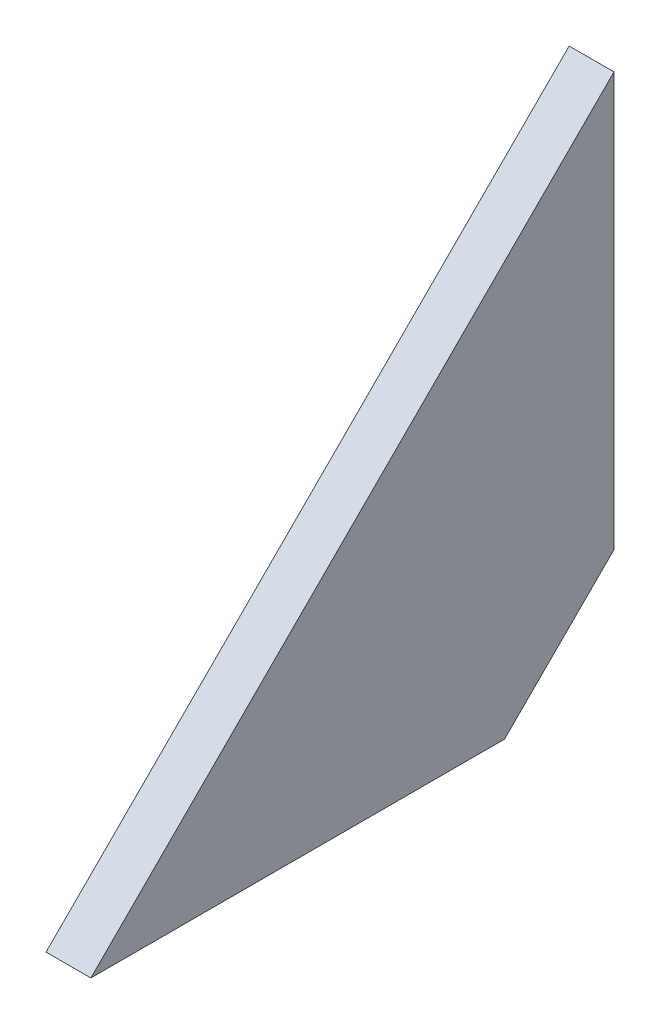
ISO-10303-21;
HEADER;
FILE_DESCRIPTION(('STEP AP214'),'2;1');
FILE_NAME('part.step','',(''),(''),'','','');
FILE_SCHEMA(('AUTOMOTIVE_DESIGN { 1 0 10303 214 1 1 1 1 }'));
ENDSEC;
DATA;
#1=APPLICATION_CONTEXT('core data for automotive mechanical design processes');
#2=APPLICATION_PROTOCOL_DEFINITION('international standard','automotive_design',2000,#1);
#3=PRODUCT_CONTEXT('',#1,'mechanical');
#4=PRODUCT('Part','Part','',(#3));
#5=PRODUCT_RELATED_PRODUCT_CATEGORY('part','',(#4));
#6=PRODUCT_DEFINITION_FORMATION('','',#4);
#7=PRODUCT_DEFINITION_CONTEXT('part definition',#1,'design');
#8=PRODUCT_DEFINITION('design','',#6,#7);
#9=PRODUCT_DEFINITION_SHAPE('','',#8);
#10=(LENGTH_UNIT() NAMED_UNIT(*) SI_UNIT(.MILLI.,.METRE.));
#11=(NAMED_UNIT(*) PLANE_ANGLE_UNIT() SI_UNIT($,.RADIAN.));
#12=(NAMED_UNIT(*) SI_UNIT($,.STERADIAN.) SOLID_ANGLE_UNIT());
#13=UNCERTAINTY_MEASURE_WITH_UNIT(LENGTH_MEASURE(1.E-05),#10,'distance_accuracy_value','');
#14=(GEOMETRIC_REPRESENTATION_CONTEXT(3) GLOBAL_UNCERTAINTY_ASSIGNED_CONTEXT((#13)) GLOBAL_UNIT_ASSIGNED_CONTEXT((#10,
#11,#12)) REPRESENTATION_CONTEXT('',''));
#15=CARTESIAN_POINT('',(0.,0.,0.));
#16=DIRECTION('',(0.,0.,1.));
#17=DIRECTION('',(1.,0.,0.));
#18=AXIS2_PLACEMENT_3D('',#15,#16,#17);
#19=CARTESIAN_POINT('',(-6.,70.,0.));
#20=DIRECTION('',(0.,0.707106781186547,0.707106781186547));
#21=DIRECTION('',(0.,-0.707106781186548,0.707106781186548));
#22=AXIS2_PLACEMENT_3D('',#19,#20,#21);
#23=PLANE('',#22);
#24=DIRECTION('',(0.,-0.707106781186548,0.707106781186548));
#25=VECTOR('',#24,1.);
#26=CARTESIAN_POINT('',(0.,70.,0.));
#27=LINE('',#26,#25);
#28=CARTESIAN_POINT('',(0.,70.,0.));
#29=VERTEX_POINT('',#28);
#30=CARTESIAN_POINT('',(0.,0.,70.));
#31=VERTEX_POINT('',#30);
#32=EDGE_CURVE('E73',#29,#31,#27,.T.);
#33=ORIENTED_EDGE('',*,*,#32,.F.);
#34=DIRECTION('',(1.,0.,0.));
#35=VECTOR('',#34,1.);
#36=CARTESIAN_POINT('',(-6.,70.,0.));
#37=LINE('',#36,#35);
#38=CARTESIAN_POINT('',(-6.,70.,0.));
#39=VERTEX_POINT('',#38);
#40=EDGE_CURVE('E11',#39,#29,#37,.T.);
#41=ORIENTED_EDGE('',*,*,#40,.F.);
#42=DIRECTION('',(0.,-0.707106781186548,0.707106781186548));
#43=VECTOR('',#42,1.);
#44=CARTESIAN_POINT('',(-6.,70.,0.));
#45=LINE('',#44,#43);
#46=CARTESIAN_POINT('',(-6.,0.,70.));
#47=VERTEX_POINT('',#46);
#48=EDGE_CURVE('E75',#39,#47,#45,.T.);
#49=ORIENTED_EDGE('',*,*,#48,.T.);
#50=DIRECTION('',(1.,0.,0.));
#51=VECTOR('',#50,1.);
#52=CARTESIAN_POINT('',(-6.,0.,70.));
#53=LINE('',#52,#51);
#54=EDGE_CURVE('E36',#47,#31,#53,.T.);
#55=ORIENTED_EDGE('',*,*,#54,.T.);
#56=EDGE_LOOP('',(#33,#41,#49,#55));
#57=FACE_BOUND('',#56,.T.);
#58=ADVANCED_FACE('F33',(#57),#23,.T.);
#59=CARTESIAN_POINT('',(-6.,14.6446609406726,0.));
#60=DIRECTION('',(0.,0.,-1.));
#61=DIRECTION('',(0.,1.,0.));
#62=AXIS2_PLACEMENT_3D('',#59,#60,#61);
#63=PLANE('',#62);
#64=DIRECTION('',(0.,1.,0.));
#65=VECTOR('',#64,1.);
#66=CARTESIAN_POINT('',(0.,14.6446609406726,0.));
#67=LINE('',#66,#65);
#68=CARTESIAN_POINT('',(0.,14.6446609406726,0.));
#69=VERTEX_POINT('',#68);
#70=EDGE_CURVE('E90',#69,#29,#67,.T.);
#71=ORIENTED_EDGE('',*,*,#70,.F.);
#72=DIRECTION('',(1.,0.,0.));
#73=VECTOR('',#72,1.);
#74=CARTESIAN_POINT('',(-6.,14.6446609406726,0.));
#75=LINE('',#74,#73);
#76=CARTESIAN_POINT('',(-6.,14.6446609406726,0.));
#77=VERTEX_POINT('',#76);
#78=EDGE_CURVE('E41',#77,#69,#75,.T.);
#79=ORIENTED_EDGE('',*,*,#78,.F.);
#80=DIRECTION('',(0.,1.,0.));
#81=VECTOR('',#80,1.);
#82=CARTESIAN_POINT('',(-6.,14.6446609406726,0.));
#83=LINE('',#82,#81);
#84=EDGE_CURVE('E80',#77,#39,#83,.T.);
#85=ORIENTED_EDGE('',*,*,#84,.T.);
#86=ORIENTED_EDGE('',*,*,#40,.T.);
#87=EDGE_LOOP('',(#71,#79,#85,#86));
#88=FACE_BOUND('',#87,.T.);
#89=ADVANCED_FACE('F105',(#88),#63,.T.);
#90=CARTESIAN_POINT('',(-6.,0.,14.6446609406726));
#91=DIRECTION('',(0.,-0.707106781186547,-0.707106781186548));
#92=DIRECTION('',(0.,0.707106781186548,-0.707106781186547));
#93=AXIS2_PLACEMENT_3D('',#90,#91,#92);
#94=PLANE('',#93);
#95=DIRECTION('',(0.,0.707106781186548,-0.707106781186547));
#96=VECTOR('',#95,1.);
#97=CARTESIAN_POINT('',(0.,0.,14.6446609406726));
#98=LINE('',#97,#96);
#99=CARTESIAN_POINT('',(0.,0.,14.6446609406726));
#100=VERTEX_POINT('',#99);
#101=EDGE_CURVE('E87',#100,#69,#98,.T.);
#102=ORIENTED_EDGE('',*,*,#101,.F.);
#103=DIRECTION('',(1.,0.,0.));
#104=VECTOR('',#103,1.);
#105=CARTESIAN_POINT('',(-6.,0.,14.6446609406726));
#106=LINE('',#105,#104);
#107=CARTESIAN_POINT('',(-6.,0.,14.6446609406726));
#108=VERTEX_POINT('',#107);
#109=EDGE_CURVE('E79',#108,#100,#106,.T.);
#110=ORIENTED_EDGE('',*,*,#109,.F.);
#111=DIRECTION('',(0.,0.707106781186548,-0.707106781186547));
#112=VECTOR('',#111,1.);
#113=CARTESIAN_POINT('',(-6.,0.,14.6446609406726));
#114=LINE('',#113,#112);
#115=EDGE_CURVE('E98',#108,#77,#114,.T.);
#116=ORIENTED_EDGE('',*,*,#115,.T.);
#117=ORIENTED_EDGE('',*,*,#78,.T.);
#118=EDGE_LOOP('',(#102,#110,#116,#117));
#119=FACE_BOUND('',#118,.T.);
#120=ADVANCED_FACE('F102',(#119),#94,.T.);
#121=CARTESIAN_POINT('',(-6.,0.,70.));
#122=DIRECTION('',(0.,-1.,0.));
#123=DIRECTION('',(0.,0.,-1.));
#124=AXIS2_PLACEMENT_3D('',#121,#122,#123);
#125=PLANE('',#124);
#126=DIRECTION('',(0.,0.,-1.));
#127=VECTOR('',#126,1.);
#128=CARTESIAN_POINT('',(0.,0.,70.));
#129=LINE('',#128,#127);
#130=EDGE_CURVE('E82',#31,#100,#129,.T.);
#131=ORIENTED_EDGE('',*,*,#130,.F.);
#132=ORIENTED_EDGE('',*,*,#54,.F.);
#133=DIRECTION('',(0.,0.,-1.));
#134=VECTOR('',#133,1.);
#135=CARTESIAN_POINT('',(-6.,0.,70.));
#136=LINE('',#135,#134);
#137=EDGE_CURVE('E96',#47,#108,#136,.T.);
#138=ORIENTED_EDGE('',*,*,#137,.T.);
#139=ORIENTED_EDGE('',*,*,#109,.T.);
#140=EDGE_LOOP('',(#131,#132,#138,#139));
#141=FACE_BOUND('',#140,.T.);
#142=ADVANCED_FACE('F83',(#141),#125,.T.);
#143=CARTESIAN_POINT('',(-6.,0.,70.));
#144=DIRECTION('',(1.,0.,0.));
#145=DIRECTION('',(0.,0.,-1.));
#146=AXIS2_PLACEMENT_3D('',#143,#144,#145);
#147=PLANE('',#146);
#148=ORIENTED_EDGE('',*,*,#48,.F.);
#149=ORIENTED_EDGE('',*,*,#84,.F.);
#150=ORIENTED_EDGE('',*,*,#115,.F.);
#151=ORIENTED_EDGE('',*,*,#137,.F.);
#152=EDGE_LOOP('',(#148,#149,#150,#151));
#153=FACE_BOUND('',#152,.T.);
#154=ADVANCED_FACE('F107',(#153),#147,.F.);
#155=CARTESIAN_POINT('',(0.,0.,70.));
#156=DIRECTION('',(1.,0.,0.));
#157=DIRECTION('',(0.,0.,-1.));
#158=AXIS2_PLACEMENT_3D('',#155,#156,#157);
#159=PLANE('',#158);
#160=ORIENTED_EDGE('',*,*,#32,.T.);
#161=ORIENTED_EDGE('',*,*,#130,.T.);
#162=ORIENTED_EDGE('',*,*,#101,.T.);
#163=ORIENTED_EDGE('',*,*,#70,.T.);
#164=EDGE_LOOP('',(#160,#161,#162,#163));
#165=FACE_BOUND('',#164,.T.);
#166=ADVANCED_FACE('F89',(#165),#159,.T.);
#167=CLOSED_SHELL('',(#58,#89,#120,#142,#154,#166));
#168=MANIFOLD_SOLID_BREP('B2',#167);
#169=ADVANCED_BREP_SHAPE_REPRESENTATION('',(#18,#168),#14);
#170=SHAPE_DEFINITION_REPRESENTATION(#9,#169);
ENDSEC;
END-ISO-10303-21;
